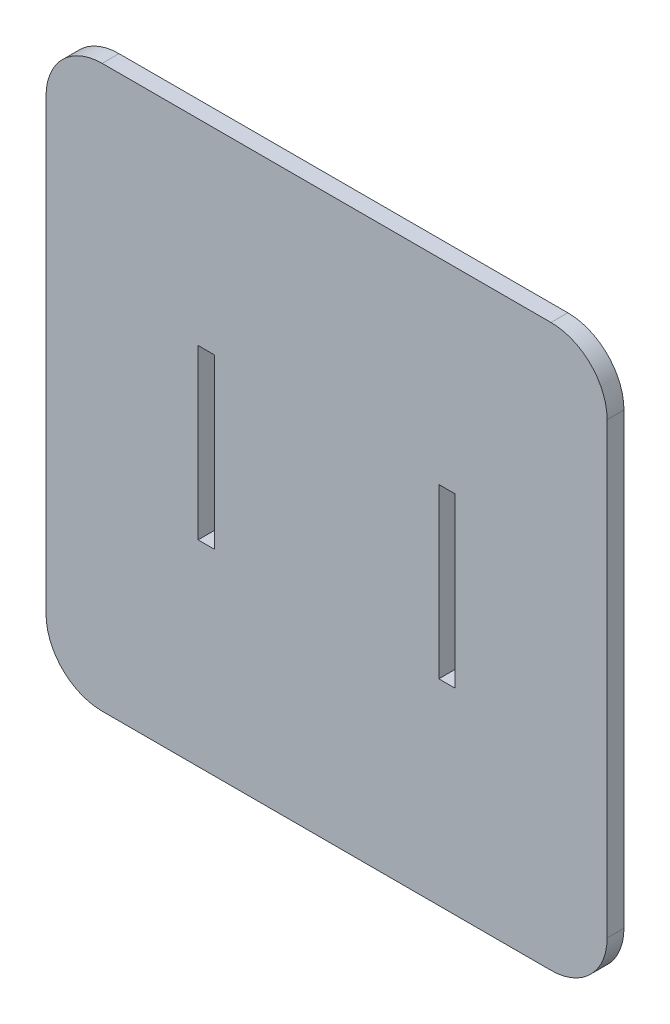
from build123d import *

# Parameters (mm, degrees)
ESQUISSE1_W        = 2.9
ESQUISSE1_H        = 30
BOSS_EXTRU_1_DEPTH = 3


with BuildPart() as part:
    # Esquisse1 → Boss.-Extru.1 (new body)
    with BuildSketch(Plane.XY):
        with BuildLine():
            Line((-40, 50), (40, 50))
            ThreePointArc((40, 50), (47.071067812, 47.071067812), (50, 40))
            Line((50, 40), (50, -40))
            ThreePointArc((50, -40), (47.071067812, -47.071067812), (40, -50))
            Line((40, -50), (-40, -50))
            ThreePointArc((-40, -50), (-47.071067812, -47.071067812), (-50, -40))
            Line((-50, -40), (-50, 40))
            ThreePointArc((-50, 40), (-47.071067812, 47.071067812), (-40, 50))
        make_face()
        with Locations((-21.45, 0)):
            Rectangle(ESQUISSE1_W, ESQUISSE1_H, mode=Mode.SUBTRACT)
        with Locations((21.45, 0)):
            Rectangle(ESQUISSE1_W, ESQUISSE1_H, mode=Mode.SUBTRACT)
    extrude(amount=BOSS_EXTRU_1_DEPTH)


solid = part.part
